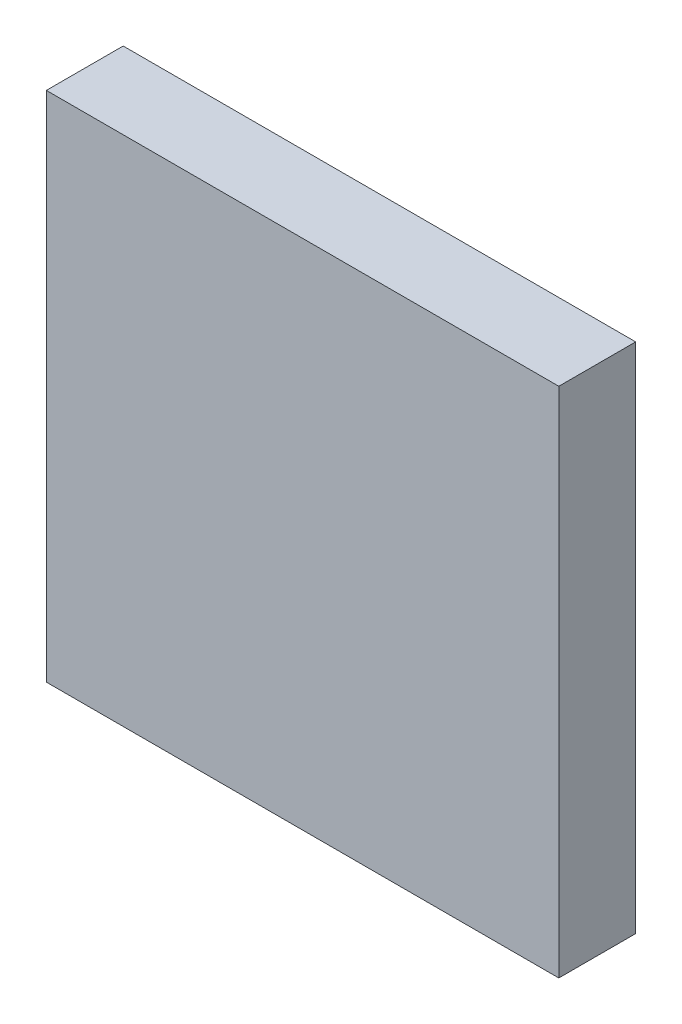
ISO-10303-21;
HEADER;
FILE_DESCRIPTION(('STEP AP214'),'2;1');
FILE_NAME('part.step','',(''),(''),'','','');
FILE_SCHEMA(('AUTOMOTIVE_DESIGN { 1 0 10303 214 1 1 1 1 }'));
ENDSEC;
DATA;
#1=APPLICATION_CONTEXT('core data for automotive mechanical design processes');
#2=APPLICATION_PROTOCOL_DEFINITION('international standard','automotive_design',2000,#1);
#3=PRODUCT_CONTEXT('',#1,'mechanical');
#4=PRODUCT('Part','Part','',(#3));
#5=PRODUCT_RELATED_PRODUCT_CATEGORY('part','',(#4));
#6=PRODUCT_DEFINITION_FORMATION('','',#4);
#7=PRODUCT_DEFINITION_CONTEXT('part definition',#1,'design');
#8=PRODUCT_DEFINITION('design','',#6,#7);
#9=PRODUCT_DEFINITION_SHAPE('','',#8);
#10=(LENGTH_UNIT() NAMED_UNIT(*) SI_UNIT(.MILLI.,.METRE.));
#11=(NAMED_UNIT(*) PLANE_ANGLE_UNIT() SI_UNIT($,.RADIAN.));
#12=(NAMED_UNIT(*) SI_UNIT($,.STERADIAN.) SOLID_ANGLE_UNIT());
#13=UNCERTAINTY_MEASURE_WITH_UNIT(LENGTH_MEASURE(1.E-05),#10,'distance_accuracy_value','');
#14=(GEOMETRIC_REPRESENTATION_CONTEXT(3) GLOBAL_UNCERTAINTY_ASSIGNED_CONTEXT((#13)) GLOBAL_UNIT_ASSIGNED_CONTEXT((#10,
#11,#12)) REPRESENTATION_CONTEXT('',''));
#15=CARTESIAN_POINT('',(0.,0.,0.));
#16=DIRECTION('',(0.,0.,1.));
#17=DIRECTION('',(1.,0.,0.));
#18=AXIS2_PLACEMENT_3D('',#15,#16,#17);
#19=CARTESIAN_POINT('',(1.269999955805E-06,1.269999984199E-06,0.2999994));
#20=DIRECTION('',(0.,0.,1.));
#21=DIRECTION('',(1.,0.,0.));
#22=AXIS2_PLACEMENT_3D('',#19,#20,#21);
#23=PLANE('',#22);
#24=DIRECTION('',(0.,1.,0.));
#25=VECTOR('',#24,1.);
#26=CARTESIAN_POINT('',(1.00000054,-0.999998,0.2999994));
#27=LINE('',#26,#25);
#28=CARTESIAN_POINT('',(1.00000054,-0.999998,0.2999994));
#29=VERTEX_POINT('',#28);
#30=CARTESIAN_POINT('',(1.00000054,1.00000054,0.2999994));
#31=VERTEX_POINT('',#30);
#32=EDGE_CURVE('E82',#29,#31,#27,.T.);
#33=ORIENTED_EDGE('',*,*,#32,.T.);
#34=DIRECTION('',(-1.,0.,0.));
#35=VECTOR('',#34,1.);
#36=CARTESIAN_POINT('',(1.00000054,1.00000054,0.2999994));
#37=LINE('',#36,#35);
#38=CARTESIAN_POINT('',(-0.999998,1.00000054,0.2999994));
#39=VERTEX_POINT('',#38);
#40=EDGE_CURVE('E111',#31,#39,#37,.T.);
#41=ORIENTED_EDGE('',*,*,#40,.T.);
#42=DIRECTION('',(0.,-1.,0.));
#43=VECTOR('',#42,1.);
#44=CARTESIAN_POINT('',(-0.999998,1.00000054,0.2999994));
#45=LINE('',#44,#43);
#46=CARTESIAN_POINT('',(-0.999998,-0.999998,0.2999994));
#47=VERTEX_POINT('',#46);
#48=EDGE_CURVE('E74',#39,#47,#45,.T.);
#49=ORIENTED_EDGE('',*,*,#48,.T.);
#50=DIRECTION('',(1.,0.,0.));
#51=VECTOR('',#50,1.);
#52=CARTESIAN_POINT('',(-0.999998,-0.999998,0.2999994));
#53=LINE('',#52,#51);
#54=EDGE_CURVE('E11',#47,#29,#53,.T.);
#55=ORIENTED_EDGE('',*,*,#54,.T.);
#56=EDGE_LOOP('',(#33,#41,#49,#55));
#57=FACE_BOUND('',#56,.T.);
#58=ADVANCED_FACE('F17',(#57),#23,.T.);
#59=CARTESIAN_POINT('',(1.269999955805E-06,1.269999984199E-06,0.));
#60=DIRECTION('',(0.,0.,1.));
#61=DIRECTION('',(1.,0.,0.));
#62=AXIS2_PLACEMENT_3D('',#59,#60,#61);
#63=PLANE('',#62);
#64=DIRECTION('',(1.,0.,0.));
#65=VECTOR('',#64,1.);
#66=CARTESIAN_POINT('',(-0.999998,-0.999998,0.));
#67=LINE('',#66,#65);
#68=CARTESIAN_POINT('',(-0.999998,-0.999998,0.));
#69=VERTEX_POINT('',#68);
#70=CARTESIAN_POINT('',(1.00000054,-0.999998,0.));
#71=VERTEX_POINT('',#70);
#72=EDGE_CURVE('E25',#69,#71,#67,.T.);
#73=ORIENTED_EDGE('',*,*,#72,.F.);
#74=DIRECTION('',(0.,-1.,0.));
#75=VECTOR('',#74,1.);
#76=CARTESIAN_POINT('',(-0.999998,1.00000054,0.));
#77=LINE('',#76,#75);
#78=CARTESIAN_POINT('',(-0.999998,1.00000054,0.));
#79=VERTEX_POINT('',#78);
#80=EDGE_CURVE('E102',#79,#69,#77,.T.);
#81=ORIENTED_EDGE('',*,*,#80,.F.);
#82=DIRECTION('',(-1.,0.,0.));
#83=VECTOR('',#82,1.);
#84=CARTESIAN_POINT('',(1.00000054,1.00000054,0.));
#85=LINE('',#84,#83);
#86=CARTESIAN_POINT('',(1.00000054,1.00000054,0.));
#87=VERTEX_POINT('',#86);
#88=EDGE_CURVE('E84',#87,#79,#85,.T.);
#89=ORIENTED_EDGE('',*,*,#88,.F.);
#90=DIRECTION('',(0.,1.,0.));
#91=VECTOR('',#90,1.);
#92=CARTESIAN_POINT('',(1.00000054,-0.999998,0.));
#93=LINE('',#92,#91);
#94=EDGE_CURVE('E80',#71,#87,#93,.T.);
#95=ORIENTED_EDGE('',*,*,#94,.F.);
#96=EDGE_LOOP('',(#73,#81,#89,#95));
#97=FACE_BOUND('',#96,.T.);
#98=ADVANCED_FACE('F86',(#97),#63,.F.);
#99=CARTESIAN_POINT('',(-0.999998,-0.999998,0.));
#100=DIRECTION('',(0.,1.,0.));
#101=DIRECTION('',(1.,0.,0.));
#102=AXIS2_PLACEMENT_3D('',#99,#100,#101);
#103=PLANE('',#102);
#104=ORIENTED_EDGE('',*,*,#72,.T.);
#105=DIRECTION('',(0.,0.,1.));
#106=VECTOR('',#105,1.);
#107=CARTESIAN_POINT('',(1.00000054,-0.999998,0.));
#108=LINE('',#107,#106);
#109=EDGE_CURVE('E68',#71,#29,#108,.T.);
#110=ORIENTED_EDGE('',*,*,#109,.T.);
#111=ORIENTED_EDGE('',*,*,#54,.F.);
#112=DIRECTION('',(0.,0.,1.));
#113=VECTOR('',#112,1.);
#114=CARTESIAN_POINT('',(-0.999998,-0.999998,0.));
#115=LINE('',#114,#113);
#116=EDGE_CURVE('E71',#69,#47,#115,.T.);
#117=ORIENTED_EDGE('',*,*,#116,.F.);
#118=EDGE_LOOP('',(#104,#110,#111,#117));
#119=FACE_BOUND('',#118,.T.);
#120=ADVANCED_FACE('F67',(#119),#103,.F.);
#121=CARTESIAN_POINT('',(-0.999998,1.00000054,0.));
#122=DIRECTION('',(1.,0.,0.));
#123=DIRECTION('',(0.,1.,0.));
#124=AXIS2_PLACEMENT_3D('',#121,#122,#123);
#125=PLANE('',#124);
#126=ORIENTED_EDGE('',*,*,#80,.T.);
#127=ORIENTED_EDGE('',*,*,#116,.T.);
#128=ORIENTED_EDGE('',*,*,#48,.F.);
#129=DIRECTION('',(0.,0.,1.));
#130=VECTOR('',#129,1.);
#131=CARTESIAN_POINT('',(-0.999998,1.00000054,0.));
#132=LINE('',#131,#130);
#133=EDGE_CURVE('E106',#79,#39,#132,.T.);
#134=ORIENTED_EDGE('',*,*,#133,.F.);
#135=EDGE_LOOP('',(#126,#127,#128,#134));
#136=FACE_BOUND('',#135,.T.);
#137=ADVANCED_FACE('F119',(#136),#125,.F.);
#138=CARTESIAN_POINT('',(1.00000054,1.00000054,0.));
#139=DIRECTION('',(0.,-1.,0.));
#140=DIRECTION('',(0.,0.,-1.));
#141=AXIS2_PLACEMENT_3D('',#138,#139,#140);
#142=PLANE('',#141);
#143=ORIENTED_EDGE('',*,*,#88,.T.);
#144=ORIENTED_EDGE('',*,*,#133,.T.);
#145=ORIENTED_EDGE('',*,*,#40,.F.);
#146=DIRECTION('',(0.,0.,1.));
#147=VECTOR('',#146,1.);
#148=CARTESIAN_POINT('',(1.00000054,1.00000054,0.));
#149=LINE('',#148,#147);
#150=EDGE_CURVE('E90',#87,#31,#149,.T.);
#151=ORIENTED_EDGE('',*,*,#150,.F.);
#152=EDGE_LOOP('',(#143,#144,#145,#151));
#153=FACE_BOUND('',#152,.T.);
#154=ADVANCED_FACE('F121',(#153),#142,.F.);
#155=CARTESIAN_POINT('',(1.00000054,-0.999998,0.));
#156=DIRECTION('',(-1.,0.,0.));
#157=DIRECTION('',(0.,0.,1.));
#158=AXIS2_PLACEMENT_3D('',#155,#156,#157);
#159=PLANE('',#158);
#160=ORIENTED_EDGE('',*,*,#94,.T.);
#161=ORIENTED_EDGE('',*,*,#150,.T.);
#162=ORIENTED_EDGE('',*,*,#32,.F.);
#163=ORIENTED_EDGE('',*,*,#109,.F.);
#164=EDGE_LOOP('',(#160,#161,#162,#163));
#165=FACE_BOUND('',#164,.T.);
#166=ADVANCED_FACE('F78',(#165),#159,.F.);
#167=CLOSED_SHELL('',(#58,#98,#120,#137,#154,#166));
#168=MANIFOLD_SOLID_BREP('B1',#167);
#169=ADVANCED_BREP_SHAPE_REPRESENTATION('',(#18,#168),#14);
#170=SHAPE_DEFINITION_REPRESENTATION(#9,#169);
ENDSEC;
END-ISO-10303-21;
